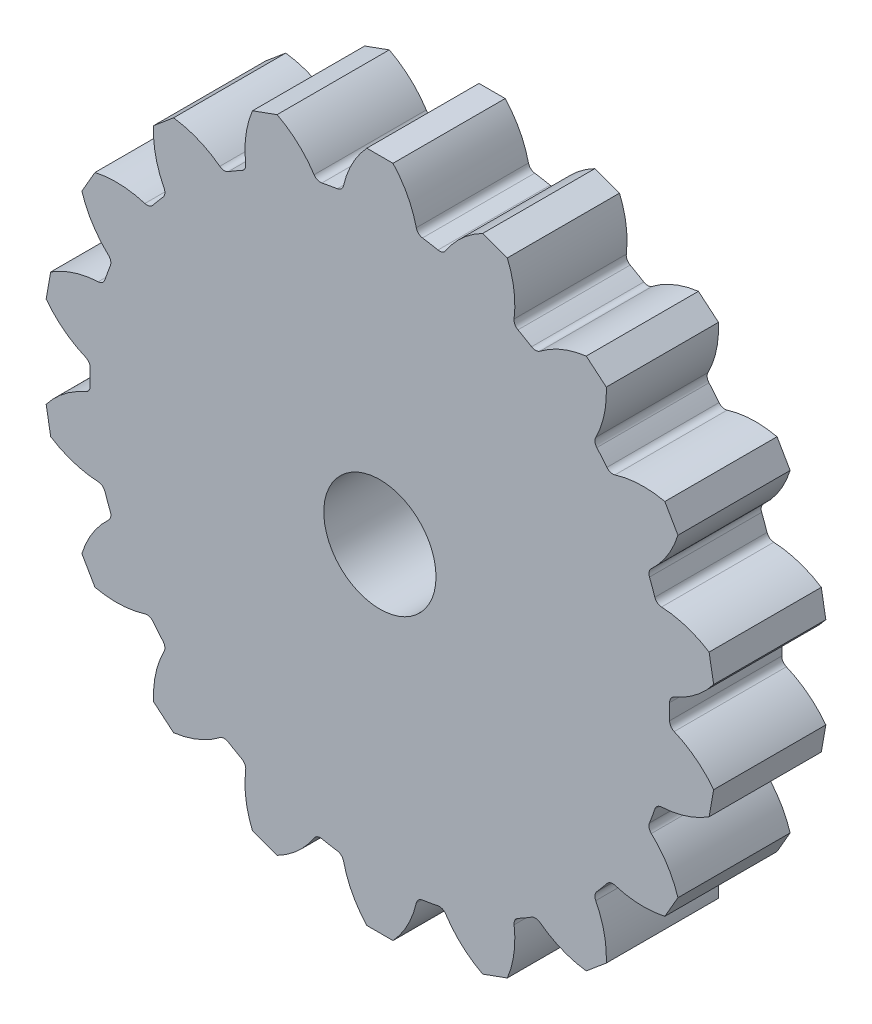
from build123d import *

# Parameters (mm, degrees)
SKETCH1_R                = 77.5
EXTRUDE1_DEPTH           = 15
EXTRUDE2_DEPTH           = 15
FILLET1_R                = 2
CIRPATTERN1_COUNT        = 18
FILLET1_OF_CIRPATTERN1_R = 2
SKETCH2_R                = 15
CUT_EXTRUDE1_DEPTH       = 131.245387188


with BuildPart() as part:
    # Sketch1 → Extrude1 (new, symmetric)
    with BuildSketch(Plane.XY):
        Circle(SKETCH1_R)
    extrude(amount=EXTRUDE1_DEPTH, both=True)

    # Sketch1_3 → Extrude2 (add, symmetric)
    with BuildSketch(Plane.XY):
        with BuildLine():
            Line((3.5, 90), (-3.5, 90))
            ThreePointArc((-3.5, 90), (-7.696315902, 83.89390189), (-10, 76.852130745))
            ThreePointArc((-10, 76.852130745), (0, 77.5), (10, 76.852130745))
            ThreePointArc((10, 76.852130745), (7.696315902, 83.89390189), (3.5, 90))
        make_face()
    extrude2 = extrude(amount=EXTRUDE2_DEPTH, both=True)

    # Fillet1
    fillet1_edges = [part.edges().sort_by_distance(p)[0] for p in [
        (-10, 76.852130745, 0),
        (10, 76.852130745, 0),
    ]]
    fillet(fillet1_edges, radius=FILLET1_R)

    # CirPattern1: Extrude2 ×18 about axis
    cirpattern1_axis = Axis((0, 0, 0), (0, 0, 1))
    for i in range(1, CIRPATTERN1_COUNT):
        add(extrude2.rotate(cirpattern1_axis, i * 360 / CIRPATTERN1_COUNT))

    # Fillet1 of CirPattern1
    fillet1_of_cirpattern1_edges = [part.edges().sort_by_distance(p)[0] for p in [
        (-35.68190298, 68.797178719, 0),
        (-16.888050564, 75.637581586, 0),
        (-57.060041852, 52.444271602, 0),
        (-41.73915299, 65.300023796, 0),
        (-71.55589756, 29.765811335, 0),
        (-61.55589756, 47.08631941, 0),
        (-77.42105597, 3.497154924, 0),
        (-73.948092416, 23.193309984, 0),
        (-73.948092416, -23.193309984, 0),
        (-77.42105597, -3.497154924, 0),
        (-61.55589756, -47.08631941, 0),
        (-71.55589756, -29.765811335, 0),
        (-41.73915299, -65.300023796, 0),
        (-57.060041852, -52.444271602, 0),
        (-16.888050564, -75.637581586, 0),
        (-35.68190298, -68.797178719, 0),
        (10, -76.852130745, 0),
        (-10, -76.852130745, 0),
        (35.68190298, -68.797178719, 0),
        (16.888050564, -75.637581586, 0),
        (57.060041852, -52.444271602, 0),
        (41.73915299, -65.300023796, 0),
        (71.55589756, -29.765811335, 0),
        (61.55589756, -47.08631941, 0),
        (77.42105597, -3.497154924, 0),
        (73.948092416, -23.193309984, 0),
        (73.948092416, 23.193309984, 0),
        (77.42105597, 3.497154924, 0),
        (61.55589756, 47.08631941, 0),
        (71.55589756, 29.765811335, 0),
        (41.73915299, 65.300023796, 0),
        (57.060041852, 52.444271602, 0),
        (16.888050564, 75.637581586, 0),
        (35.68190298, 68.797178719, 0),
    ]]
    fillet(fillet1_of_cirpattern1_edges, radius=FILLET1_OF_CIRPATTERN1_R)

    # Sketch2 → Cut-Extrude1 (cut, through all)
    with BuildSketch(Plane.XY.offset(15)):
        Circle(SKETCH2_R)
    extrude(amount=-CUT_EXTRUDE1_DEPTH, mode=Mode.SUBTRACT)


solid = part.part
